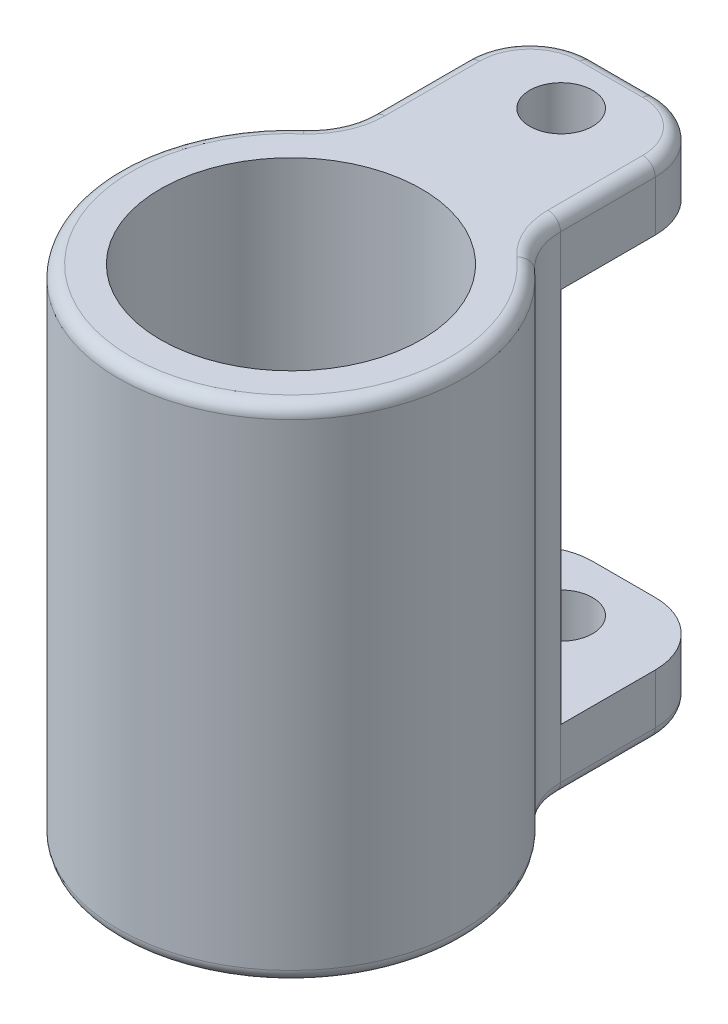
from build123d import *

# Parameters (mm, degrees)
SKETCH1_R                    = 6.604
BOSS_EXTRUDE1_DEPTH          = 25.4
CUT_EXTRUDE1_REACH           = 35.331
SKETCH2_W                    = 7.9375
SKETCH2_H                    = 19.05
FILLET1_R                    = 3.175
F_1_8_0_125_DIAMETER_HOLE1_D = 3.175
FILLET2_R                    = 0.635


with BuildPart() as part:
    # Sketch1 → Boss-Extrude1 (new body)
    with BuildSketch(Plane(origin=(0, 0, 0), x_dir=(1, 0, 0), z_dir=(0, 1, 0))):
        with BuildLine():
            Line((-4.7625, 7.318013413), (-4.7625, 13.668013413))
            ThreePointArc((-4.7625, 13.668013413), (-3.83256403, 15.913077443), (-1.5875, 16.843013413))
            Line((-1.5875, 16.843013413), (1.5875, 16.843013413))
            ThreePointArc((1.5875, 16.843013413), (3.83256403, 15.913077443), (4.7625, 13.668013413))
            Line((4.7625, 13.668013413), (4.7625, 7.318013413))
            ThreePointArc((4.7625, 7.318013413), (0, -8.73125), (-4.7625, 7.318013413))
        make_face()
        with Locations(Location((0, 0, 0), (0, 0, 270))):
            Circle(SKETCH1_R, mode=Mode.SUBTRACT)
    extrude(amount=BOSS_EXTRUDE1_DEPTH)

    # Sketch2 → Cut-Extrude1 (cut, up to next)
    with BuildSketch(Plane(origin=(4.7625, 0, 0), x_dir=(0, 0, -1), z_dir=(1, 0, 0)), mode=Mode.PRIVATE) as cut_extrude1_sk1:
        with Locations((12.874263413, 12.7)):
            Rectangle(SKETCH2_W, SKETCH2_H)
    cut_extrude1_tool1 = extrude(cut_extrude1_sk1.sketch, amount=-CUT_EXTRUDE1_REACH, mode=Mode.PRIVATE) & part.part
    add(cut_extrude1_tool1.solids().sort_by_distance((4.7625, 12.7, -12.874263))[0], mode=Mode.SUBTRACT)

    # Fillet1
    fillet1_edges = [part.edges().sort_by_distance(p)[0] for p in [
        (4.7625, 12.7, -7.318013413),
        (-4.7625, 12.7, -7.318013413),
    ]]
    fillet(fillet1_edges, radius=FILLET1_R)

    # 1_8 _0.125_ Diameter Hole1 (through all)
    with Locations(Plane(origin=(0, 25.4, 0), x_dir=(1, 0, 0), z_dir=(0, 1, 0))):
        with Locations((0, 13.668013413)):
            Hole(F_1_8_0_125_DIAMETER_HOLE1_D / 2)

    # Fillet2
    fillet2_edges = [part.edges().sort_by_distance(p)[0] for p in [
        (-3.83256403, 25.4, -15.913077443),
        (-4.7625, 25.4, -11.271204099),
        (3.83256403, 25.4, -15.913077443),
        (4.7625, 25.4, -11.271204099),
        (4.7625, 0, -11.271204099),
        (0, 0, 8.73125),
        (0, 25.4, 8.73125),
        (5.0391348, 0, -7.578206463),
        (5.0391348, 25.4, -7.578206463),
        (-5.0391348, 0, -7.578206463),
        (-5.0391348, 25.4, -7.578206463),
        (-4.7625, 0, -11.271204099),
        (0, 25.4, -16.843013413),
        (-3.83256403, 0, -15.913077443),
        (0, 0, -16.843013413),
        (3.83256403, 0, -15.913077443),
    ]]
    fillet(fillet2_edges, radius=FILLET2_R)


solid = part.part
